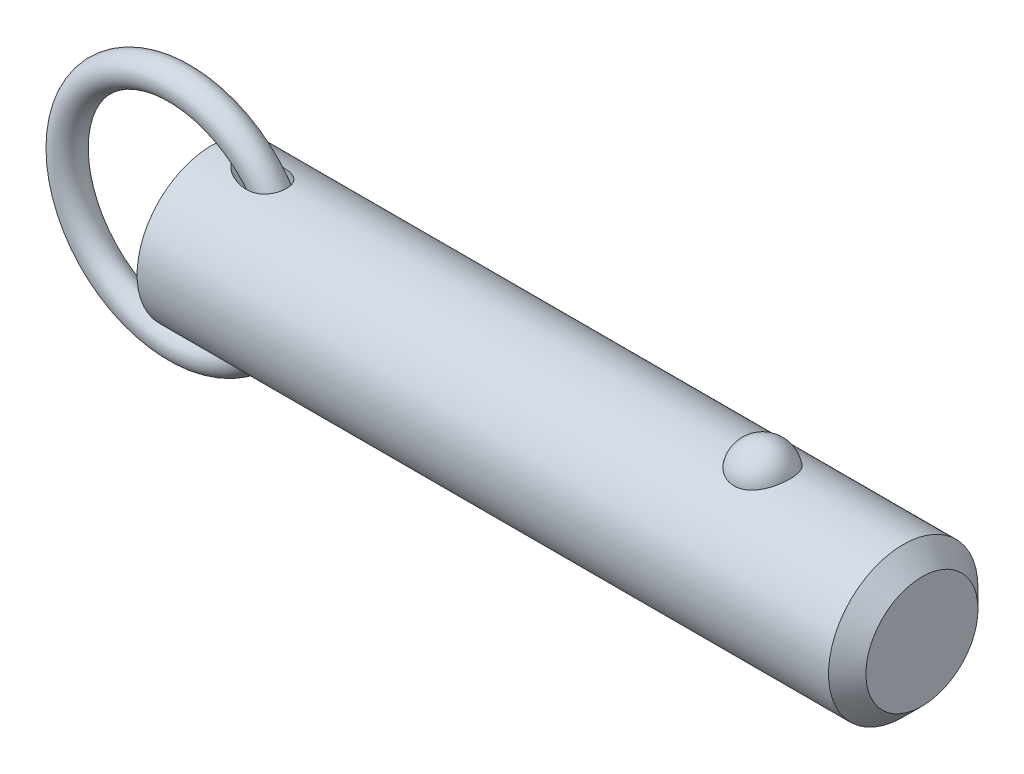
ISO-10303-21;
HEADER;
FILE_DESCRIPTION(('STEP AP214'),'2;1');
FILE_NAME('part.step','',(''),(''),'','','');
FILE_SCHEMA(('AUTOMOTIVE_DESIGN { 1 0 10303 214 1 1 1 1 }'));
ENDSEC;
DATA;
#1=APPLICATION_CONTEXT('core data for automotive mechanical design processes');
#2=APPLICATION_PROTOCOL_DEFINITION('international standard','automotive_design',2000,#1);
#3=PRODUCT_CONTEXT('',#1,'mechanical');
#4=PRODUCT('Part','Part','',(#3));
#5=PRODUCT_RELATED_PRODUCT_CATEGORY('part','',(#4));
#6=PRODUCT_DEFINITION_FORMATION('','',#4);
#7=PRODUCT_DEFINITION_CONTEXT('part definition',#1,'design');
#8=PRODUCT_DEFINITION('design','',#6,#7);
#9=PRODUCT_DEFINITION_SHAPE('','',#8);
#10=(LENGTH_UNIT() NAMED_UNIT(*) SI_UNIT(.MILLI.,.METRE.));
#11=(NAMED_UNIT(*) PLANE_ANGLE_UNIT() SI_UNIT($,.RADIAN.));
#12=(NAMED_UNIT(*) SI_UNIT($,.STERADIAN.) SOLID_ANGLE_UNIT());
#13=UNCERTAINTY_MEASURE_WITH_UNIT(LENGTH_MEASURE(1.E-05),#10,'distance_accuracy_value','');
#14=(GEOMETRIC_REPRESENTATION_CONTEXT(3) GLOBAL_UNCERTAINTY_ASSIGNED_CONTEXT((#13)) GLOBAL_UNIT_ASSIGNED_CONTEXT((#10,
#11,#12)) REPRESENTATION_CONTEXT('',''));
#15=CARTESIAN_POINT('',(0.,0.,0.));
#16=DIRECTION('',(0.,0.,1.));
#17=DIRECTION('',(1.,0.,0.));
#18=AXIS2_PLACEMENT_3D('',#15,#16,#17);
#19=CARTESIAN_POINT('',(-5.53898640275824,0.,0.));
#20=DIRECTION('',(0.,0.,1.));
#21=DIRECTION('',(1.,0.,0.));
#22=AXIS2_PLACEMENT_3D('',#19,#20,#21);
#23=TOROIDAL_SURFACE('',#22,19.05,2.54);
#24=CARTESIAN_POINT('',(16.0510135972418,0.,0.));
#25=VERTEX_POINT('',#24);
#26=VERTEX_LOOP('',#25);
#27=FACE_BOUND('',#26,.T.);
#28=ADVANCED_FACE('P0_F12',(#27),#23,.T.);
#29=CLOSED_SHELL('',(#28));
#30=MANIFOLD_SOLID_BREP('P0_B1',#29);
#31=CARTESIAN_POINT('',(0.,0.,0.));
#32=DIRECTION('',(1.,0.,0.));
#33=DIRECTION('',(0.,0.,-1.));
#34=AXIS2_PLACEMENT_3D('',#31,#32,#33);
#35=CYLINDRICAL_SURFACE('',#34,12.7);
#36=CARTESIAN_POINT('',(117.475,0.,0.));
#37=DIRECTION('',(1.,0.,0.));
#38=DIRECTION('',(0.,0.,-1.));
#39=AXIS2_PLACEMENT_3D('',#36,#37,#38);
#40=CIRCLE('',#39,12.7);
#41=CARTESIAN_POINT('',(117.475,0.,-12.7));
#42=VERTEX_POINT('',#41);
#43=EDGE_CURVE('P1_E89',#42,#42,#40,.T.);
#44=ORIENTED_EDGE('',*,*,#43,.F.);
#45=EDGE_LOOP('',(#44));
#46=FACE_BOUND('',#45,.T.);
#47=CARTESIAN_POINT('',(0.,0.,0.));
#48=DIRECTION('',(1.,0.,0.));
#49=DIRECTION('',(0.,0.,-1.));
#50=AXIS2_PLACEMENT_3D('',#47,#48,#49);
#51=CIRCLE('',#50,12.7);
#52=CARTESIAN_POINT('',(0.,0.,-12.7));
#53=VERTEX_POINT('',#52);
#54=EDGE_CURVE('P1_E52',#53,#53,#51,.T.);
#55=ORIENTED_EDGE('',*,*,#54,.T.);
#56=EDGE_LOOP('',(#55));
#57=FACE_BOUND('',#56,.T.);
#58=CARTESIAN_POINT('',(93.5600429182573,11.7500437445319,4.81938502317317));
#59=CARTESIAN_POINT('',(93.4350881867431,11.7500430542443,4.8193857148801));
#60=CARTESIAN_POINT('',(93.3101442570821,11.7520975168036,4.81438658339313));
#61=CARTESIAN_POINT('',(93.0611425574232,11.760253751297,4.79442904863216));
#62=CARTESIAN_POINT('',(92.9370850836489,11.7663568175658,4.77946746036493));
#63=CARTESIAN_POINT('',(92.6909016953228,11.7824262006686,4.73971414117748));
#64=CARTESIAN_POINT('',(92.5687744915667,11.7923898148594,4.71492928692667));
#65=CARTESIAN_POINT('',(92.3271874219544,11.8158938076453,4.65571340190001));
#66=CARTESIAN_POINT('',(92.2077285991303,11.8294355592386,4.62127866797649));
#67=CARTESIAN_POINT('',(91.9725578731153,11.8596812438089,4.54309502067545));
#68=CARTESIAN_POINT('',(91.8568393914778,11.8763792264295,4.49936361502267));
#69=CARTESIAN_POINT('',(91.6296530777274,11.9124878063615,4.40287235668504));
#70=CARTESIAN_POINT('',(91.5181868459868,11.9318994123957,4.35010914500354));
#71=CARTESIAN_POINT('',(91.1912782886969,11.9934256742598,4.1788131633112));
#72=CARTESIAN_POINT('',(90.9831270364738,12.038858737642,4.04720756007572));
#73=CARTESIAN_POINT('',(90.5858509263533,12.1352173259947,3.74856446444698));
#74=CARTESIAN_POINT('',(90.3974438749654,12.1862630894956,3.58061821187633));
#75=CARTESIAN_POINT('',(90.0505213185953,12.2875163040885,3.21600758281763));
#76=CARTESIAN_POINT('',(89.8920113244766,12.3377235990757,3.01933792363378));
#77=CARTESIAN_POINT('',(89.6016887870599,12.4344923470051,2.59291655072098));
#78=CARTESIAN_POINT('',(89.4713762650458,12.4807925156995,2.36208286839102));
#79=CARTESIAN_POINT('',(89.2494079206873,12.5623454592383,1.88070399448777));
#80=CARTESIAN_POINT('',(89.1577554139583,12.5975972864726,1.63015711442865));
#81=CARTESIAN_POINT('',(89.0140466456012,12.6538414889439,1.11298869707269));
#82=CARTESIAN_POINT('',(88.9624990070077,12.6746503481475,0.846205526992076));
#83=CARTESIAN_POINT('',(88.9019771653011,12.699153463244,0.307085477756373));
#84=CARTESIAN_POINT('',(88.8930018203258,12.7028481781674,0.0347487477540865));
#85=CARTESIAN_POINT('',(88.9177310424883,12.6927785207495,-0.506073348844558));
#86=CARTESIAN_POINT('',(88.9511899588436,12.6791146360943,-0.774571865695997));
#87=CARTESIAN_POINT('',(89.059687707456,12.635882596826,-1.30170246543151));
#88=CARTESIAN_POINT('',(89.1347272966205,12.606314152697,-1.5603343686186));
#89=CARTESIAN_POINT('',(89.3250000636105,12.5342328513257,-2.06083899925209));
#90=CARTESIAN_POINT('',(89.4402872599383,12.4917026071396,-2.30268867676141));
#91=CARTESIAN_POINT('',(89.7087044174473,12.3981123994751,-2.76259600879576));
#92=CARTESIAN_POINT('',(89.8618374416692,12.3470517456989,-2.98065173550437));
#93=CARTESIAN_POINT('',(90.2035077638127,12.2416045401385,-3.38786328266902));
#94=CARTESIAN_POINT('',(90.3922017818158,12.1872040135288,-3.57688418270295));
#95=CARTESIAN_POINT('',(90.8002392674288,12.0814086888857,-3.91941073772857));
#96=CARTESIAN_POINT('',(91.0195800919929,12.0300136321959,-4.07291945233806));
#97=CARTESIAN_POINT('',(91.4783753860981,11.9373542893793,-4.33691289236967));
#98=CARTESIAN_POINT('',(91.717304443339,11.8958982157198,-4.44824125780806));
#99=CARTESIAN_POINT('',(92.2124376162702,11.8268116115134,-4.62881985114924));
#100=CARTESIAN_POINT('',(92.4686351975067,11.7991758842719,-4.69808589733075));
#101=CARTESIAN_POINT('',(92.9771640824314,11.7622209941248,-4.78983181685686));
#102=CARTESIAN_POINT('',(93.2290414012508,11.7520502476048,-4.81449025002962));
#103=CARTESIAN_POINT('',(93.7335734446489,11.7485796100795,-4.82295735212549));
#104=CARTESIAN_POINT('',(93.9862280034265,11.7552763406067,-4.80677420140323));
#105=CARTESIAN_POINT('',(94.476834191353,11.7842584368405,-4.735254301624));
#106=CARTESIAN_POINT('',(94.7149984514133,11.8060486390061,-4.68116061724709));
#107=CARTESIAN_POINT('',(95.1784894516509,11.8622750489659,-4.53678133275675));
#108=CARTESIAN_POINT('',(95.4038151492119,11.8967122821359,-4.44649279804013));
#109=CARTESIAN_POINT('',(95.8408018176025,11.9754603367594,-4.22987613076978));
#110=CARTESIAN_POINT('',(96.0520579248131,12.0199699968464,-4.10280539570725));
#111=CARTESIAN_POINT('',(96.4506012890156,12.1138028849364,-3.81685409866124));
#112=CARTESIAN_POINT('',(96.6378830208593,12.163127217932,-3.65796622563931));
#113=CARTESIAN_POINT('',(96.9933509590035,12.2642343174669,-3.30364864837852));
#114=CARTESIAN_POINT('',(97.1601119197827,12.3160165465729,-3.10678783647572));
#115=CARTESIAN_POINT('',(97.4595799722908,12.4142566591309,-2.6874840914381));
#116=CARTESIAN_POINT('',(97.5922809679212,12.4607135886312,-2.46503658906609));
#117=CARTESIAN_POINT('',(97.8246912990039,12.5450236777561,-1.99289519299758));
#118=CARTESIAN_POINT('',(97.923215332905,12.5825557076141,-1.74255918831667));
#119=CARTESIAN_POINT('',(98.0792277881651,12.6431720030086,-1.2277373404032));
#120=CARTESIAN_POINT('',(98.1367157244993,12.6662560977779,-0.963251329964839));
#121=CARTESIAN_POINT('',(98.2095441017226,12.6956486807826,-0.427355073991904));
#122=CARTESIAN_POINT('',(98.2248378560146,12.7019385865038,-0.155937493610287));
#123=CARTESIAN_POINT('',(98.2127794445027,12.6970201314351,0.385928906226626));
#124=CARTESIAN_POINT('',(98.1854280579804,12.6858120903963,0.656377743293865));
#125=CARTESIAN_POINT('',(98.1130609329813,12.6568455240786,1.05454017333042));
#126=CARTESIAN_POINT('',(98.0837963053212,12.6451962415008,1.185778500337));
#127=CARTESIAN_POINT('',(98.0150228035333,12.6181819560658,1.4451380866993));
#128=CARTESIAN_POINT('',(97.9755176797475,12.6028183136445,1.57326046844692));
#129=CARTESIAN_POINT('',(97.8864397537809,12.5687547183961,1.82554978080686));
#130=CARTESIAN_POINT('',(97.8368627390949,12.5500533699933,1.9497150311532));
#131=CARTESIAN_POINT('',(97.7279211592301,12.5098093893,2.19314370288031));
#132=CARTESIAN_POINT('',(97.6685601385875,12.4882677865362,2.31240887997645));
#133=CARTESIAN_POINT('',(97.5399712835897,12.4427679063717,2.54593031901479));
#134=CARTESIAN_POINT('',(97.4706888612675,12.4187964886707,2.66015396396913));
#135=CARTESIAN_POINT('',(97.322903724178,12.3691892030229,2.88202659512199));
#136=CARTESIAN_POINT('',(97.2444044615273,12.3435539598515,2.98967802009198));
#137=CARTESIAN_POINT('',(97.0785502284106,12.2912955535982,3.19774385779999));
#138=CARTESIAN_POINT('',(96.9911918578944,12.2646720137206,3.29815546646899));
#139=CARTESIAN_POINT('',(96.8081617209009,12.2111945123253,3.49095035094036));
#140=CARTESIAN_POINT('',(96.7124932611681,12.1843406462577,3.58333679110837));
#141=CARTESIAN_POINT('',(96.5136272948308,12.1312249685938,3.75922876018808));
#142=CARTESIAN_POINT('',(96.4104503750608,12.104961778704,3.84275713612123));
#143=CARTESIAN_POINT('',(96.1970133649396,12.0537284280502,4.00056406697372));
#144=CARTESIAN_POINT('',(96.0867562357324,12.028757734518,4.07484645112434));
#145=CARTESIAN_POINT('',(95.8597550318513,11.9808306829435,4.21367959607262));
#146=CARTESIAN_POINT('',(95.7430068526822,11.9578756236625,4.27822410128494));
#147=CARTESIAN_POINT('',(95.5039425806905,11.9147184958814,4.39698483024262));
#148=CARTESIAN_POINT('',(95.3816287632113,11.894515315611,4.45120522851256));
#149=CARTESIAN_POINT('',(95.122952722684,11.8561129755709,4.55255353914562));
#150=CARTESIAN_POINT('',(94.9862237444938,11.8381764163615,4.59884858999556));
#151=CARTESIAN_POINT('',(94.7086087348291,11.8069093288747,4.678538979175));
#152=CARTESIAN_POINT('',(94.5677245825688,11.7935767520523,4.71194005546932));
#153=CARTESIAN_POINT('',(94.2830944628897,11.7720277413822,4.76552188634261));
#154=CARTESIAN_POINT('',(94.1393488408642,11.7638106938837,4.78570422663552));
#155=CARTESIAN_POINT('',(93.8504114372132,11.7528195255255,4.81263433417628));
#156=CARTESIAN_POINT('',(93.7052198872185,11.7500445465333,4.81938421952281));
#157=CARTESIAN_POINT('',(93.5600429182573,11.7500437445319,4.81938502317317));
#158=B_SPLINE_CURVE_WITH_KNOTS('',3,(#58,#59,#60,#61,#62,#63,#64,#65,#66,#67,#68,#69,#70,#71,
#72,#73,#74,#75,#76,#77,#78,#79,#80,#81,#82,#83,#84,#85,#86,#87,#88,#89,#90,#91,#92,#93,#94,#95,
#96,#97,#98,#99,#100,#101,#102,#103,#104,#105,#106,#107,#108,#109,#110,#111,#112,#113,#114,#115,
#116,#117,#118,#119,#120,#121,#122,#123,#124,#125,#126,#127,#128,#129,#130,#131,#132,#133,#134,
#135,#136,#137,#138,#139,#140,#141,#142,#143,#144,#145,#146,#147,#148,#149,#150,#151,#152,#153,
#154,#155,#156,#157),.UNSPECIFIED.,.T.,.F.,(4,2,2,2,2,2,2,2,2,2,2,2,2,2,2,2,2,2,2,2,2,2,2,2,2,2,
2,2,2,2,2,2,2,2,2,2,2,2,2,2,2,2,2,2,2,2,2,2,2,4),(0.,0.374729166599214,0.749578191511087,
1.1241652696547,1.49889629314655,1.87292776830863,2.24709865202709,2.99481328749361,
3.76399449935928,4.53331735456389,5.3368391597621,6.14042986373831,6.95405296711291,
7.76765424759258,8.57656703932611,9.38549455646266,10.1955119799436,11.0055949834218,
11.8193353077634,12.6330054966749,13.4294141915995,14.2255231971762,14.9815786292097,
15.7374826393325,16.4696948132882,17.2019663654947,17.9501979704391,18.6986017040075,
19.484470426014,20.2704797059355,21.0815215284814,21.8925729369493,22.7045213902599,
23.5164550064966,23.9209608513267,24.3253187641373,24.7298461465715,25.1342272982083,
25.54092555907,25.9474719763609,26.3541750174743,26.7607169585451,27.1661834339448,
27.5714814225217,27.9770386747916,28.382431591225,28.818120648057,29.2536155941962,
29.6890582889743,30.1244323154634),.UNSPECIFIED.);
#159=CARTESIAN_POINT('',(93.5600429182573,11.7500437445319,4.81938502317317));
#160=VERTEX_POINT('',#159);
#161=EDGE_CURVE('P1_E80',#160,#160,#158,.T.);
#162=ORIENTED_EDGE('',*,*,#161,.T.);
#163=EDGE_LOOP('',(#162));
#164=FACE_BOUND('',#163,.T.);
#165=CARTESIAN_POINT('',(-5.53898640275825,0.,0.));
#166=DIRECTION('',(0.796400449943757,-0.604769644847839,0.));
#167=DIRECTION('',(0.604769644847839,0.796400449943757,0.));
#168=AXIS2_PLACEMENT_3D('',#165,#166,#167);
#169=ELLIPSE('',#168,15.9467514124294,12.7);
#170=CARTESIAN_POINT('',(4.09482149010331,12.6864319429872,0.586893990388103));
#171=VERTEX_POINT('',#170);
#172=CARTESIAN_POINT('',(4.09482149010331,12.6864319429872,-0.586893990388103));
#173=VERTEX_POINT('',#172);
#174=EDGE_CURVE('P1_E47',#171,#173,#169,.F.);
#175=ORIENTED_EDGE('',*,*,#174,.T.);
#176=CARTESIAN_POINT('',(4.06153170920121,12.6905758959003,-0.48916605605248));
#177=CARTESIAN_POINT('',(4.08111374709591,12.6881366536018,-0.552489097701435));
#178=CARTESIAN_POINT('',(4.10417851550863,12.6852663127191,-0.614604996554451));
#179=CARTESIAN_POINT('',(4.15628434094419,12.6787965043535,-0.736067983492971));
#180=CARTESIAN_POINT('',(4.18531032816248,12.6751988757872,-0.795421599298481));
#181=CARTESIAN_POINT('',(4.27911159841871,12.6636052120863,-0.967590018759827));
#182=CARTESIAN_POINT('',(4.35123408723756,12.654730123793,-1.07635920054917));
#183=CARTESIAN_POINT('',(4.49106800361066,12.6376715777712,-1.25922957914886));
#184=CARTESIAN_POINT('',(4.5560106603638,12.6297947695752,-1.33556751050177));
#185=CARTESIAN_POINT('',(4.69223626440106,12.6134116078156,-1.48232741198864));
#186=CARTESIAN_POINT('',(4.7635214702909,12.6049050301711,-1.55274725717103));
#187=CARTESIAN_POINT('',(4.91163946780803,12.587417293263,-1.68868704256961));
#188=CARTESIAN_POINT('',(4.98851399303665,12.5784327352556,-1.75416062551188));
#189=CARTESIAN_POINT('',(5.14630057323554,12.560235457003,-1.88003275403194));
#190=CARTESIAN_POINT('',(5.22721398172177,12.5510226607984,-1.94042957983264));
#191=CARTESIAN_POINT('',(5.45368877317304,12.5256514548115,-2.09966332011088));
#192=CARTESIAN_POINT('',(5.60261616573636,12.5094182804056,-2.19371988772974));
#193=CARTESIAN_POINT('',(5.90795545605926,12.4774211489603,-2.36893890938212));
#194=CARTESIAN_POINT('',(6.06437232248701,12.4616575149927,-2.45009264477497));
#195=CARTESIAN_POINT('',(6.38306132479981,12.431227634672,-2.60008249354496));
#196=CARTESIAN_POINT('',(6.54533237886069,12.4165611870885,-2.66892086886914));
#197=CARTESIAN_POINT('',(6.87462618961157,12.3889351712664,-2.79435199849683));
#198=CARTESIAN_POINT('',(7.0416477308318,12.3759751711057,-2.85094785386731));
#199=CARTESIAN_POINT('',(7.38726647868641,12.3518460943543,-2.95377962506));
#200=CARTESIAN_POINT('',(7.56604577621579,12.3407843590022,-2.9994320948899));
#201=CARTESIAN_POINT('',(7.92698692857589,12.3219309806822,-3.07596683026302));
#202=CARTESIAN_POINT('',(8.10914972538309,12.314140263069,-3.1068449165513));
#203=CARTESIAN_POINT('',(8.47511457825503,12.3025918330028,-3.15226850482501));
#204=CARTESIAN_POINT('',(8.6589097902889,12.2988216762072,-3.16686440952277));
#205=CARTESIAN_POINT('',(9.02696087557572,12.2959421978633,-3.17802250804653));
#206=CARTESIAN_POINT('',(9.21121628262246,12.2968292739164,-3.17459864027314));
#207=CARTESIAN_POINT('',(9.61636263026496,12.3045198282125,-3.14471110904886));
#208=CARTESIAN_POINT('',(9.83695552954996,12.3125080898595,-3.1136323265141));
#209=CARTESIAN_POINT('',(10.1619126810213,12.3303028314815,-3.04206574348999));
#210=CARTESIAN_POINT('',(10.2692747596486,12.3372061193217,-3.01403983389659));
#211=CARTESIAN_POINT('',(10.4811758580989,12.3528538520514,-2.94925947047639));
#212=CARTESIAN_POINT('',(10.5857162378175,12.361597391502,-2.91250930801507));
#213=CARTESIAN_POINT('',(10.7921321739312,12.3808585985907,-2.82951748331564));
#214=CARTESIAN_POINT('',(10.8939665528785,12.3913944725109,-2.78317723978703));
#215=CARTESIAN_POINT('',(11.0926118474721,12.4138762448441,-2.68112002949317));
#216=CARTESIAN_POINT('',(11.1894254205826,12.4258213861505,-2.62540809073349));
#217=CARTESIAN_POINT('',(11.3768740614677,12.4507225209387,-2.50465655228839));
#218=CARTESIAN_POINT('',(11.46751150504,12.4636781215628,-2.43962056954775));
#219=CARTESIAN_POINT('',(11.6414572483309,12.4901070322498,-2.30048560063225));
#220=CARTESIAN_POINT('',(11.7247669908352,12.5035802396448,-2.2263884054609));
#221=CARTESIAN_POINT('',(11.8713131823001,12.5285000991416,-2.08117367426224));
#222=CARTESIAN_POINT('',(11.9357009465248,12.5399538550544,-2.0112159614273));
#223=CARTESIAN_POINT('',(12.0576805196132,12.5624496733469,-1.86555293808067));
#224=CARTESIAN_POINT('',(12.1152732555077,12.5734917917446,-1.7898484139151));
#225=CARTESIAN_POINT('',(12.2230738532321,12.5947858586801,-1.63327883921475));
#226=CARTESIAN_POINT('',(12.2732844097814,12.6050380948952,-1.55241568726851));
#227=CARTESIAN_POINT('',(12.3658430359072,12.6243983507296,-1.38621267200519));
#228=CARTESIAN_POINT('',(12.4081916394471,12.6335064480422,-1.30087311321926));
#229=CARTESIAN_POINT('',(12.5150098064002,12.6569076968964,-1.05702619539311));
#230=CARTESIAN_POINT('',(12.5703399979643,12.6695746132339,-0.894232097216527));
#231=CARTESIAN_POINT('',(12.6526225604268,12.6886816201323,-0.561391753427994));
#232=CARTESIAN_POINT('',(12.6795825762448,12.6951233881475,-0.391347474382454));
#233=CARTESIAN_POINT('',(12.7041016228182,12.7009766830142,-0.0537636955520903));
#234=CARTESIAN_POINT('',(12.7024538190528,12.7005778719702,0.113714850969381));
#235=CARTESIAN_POINT('',(12.6717240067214,12.6932548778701,0.445979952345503));
#236=CARTESIAN_POINT('',(12.6426435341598,12.6863310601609,0.610766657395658));
#237=CARTESIAN_POINT('',(12.5579769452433,12.6667465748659,0.93242957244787));
#238=CARTESIAN_POINT('',(12.5024793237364,12.6541050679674,1.08933027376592));
#239=CARTESIAN_POINT('',(12.3665691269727,12.6244558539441,1.39146752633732));
#240=CARTESIAN_POINT('',(12.2861577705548,12.6074483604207,1.53670464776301));
#241=CARTESIAN_POINT('',(12.1018203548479,12.5706804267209,1.81319588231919));
#242=CARTESIAN_POINT('',(11.9976588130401,12.5508932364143,1.94428915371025));
#243=CARTESIAN_POINT('',(11.7695265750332,12.5107540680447,2.18776051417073));
#244=CARTESIAN_POINT('',(11.6455540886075,12.4904020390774,2.30013691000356));
#245=CARTESIAN_POINT('',(11.3759347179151,12.4502278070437,2.50870972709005));
#246=CARTESIAN_POINT('',(11.2295880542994,12.4304654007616,2.60400962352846));
#247=CARTESIAN_POINT('',(10.9239803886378,12.3941696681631,2.7716292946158));
#248=CARTESIAN_POINT('',(10.7647152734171,12.3776373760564,2.84394171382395));
#249=CARTESIAN_POINT('',(10.4192039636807,12.3473062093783,2.9730352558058));
#250=CARTESIAN_POINT('',(10.231933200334,12.3340204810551,3.02717164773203));
#251=CARTESIAN_POINT('',(9.85152982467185,12.3134301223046,3.10986173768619));
#252=CARTESIAN_POINT('',(9.65839336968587,12.3061295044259,3.13839827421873));
#253=CARTESIAN_POINT('',(9.31022514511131,12.2982822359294,3.16897517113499));
#254=CARTESIAN_POINT('',(9.15555718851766,12.2966525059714,3.1752689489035));
#255=CARTESIAN_POINT('',(8.84618945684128,12.2967963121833,3.17471335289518));
#256=CARTESIAN_POINT('',(8.69148970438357,12.2985715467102,3.16785742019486));
#257=CARTESIAN_POINT('',(8.38280471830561,12.3051648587,3.14214692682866));
#258=CARTESIAN_POINT('',(8.22882218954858,12.3099904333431,3.12326280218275));
#259=CARTESIAN_POINT('',(7.92276070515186,12.3222644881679,3.07448013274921));
#260=CARTESIAN_POINT('',(7.77068148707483,12.3297126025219,3.04458312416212));
#261=CARTESIAN_POINT('',(7.46452663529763,12.3470493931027,2.97350781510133));
#262=CARTESIAN_POINT('',(7.31052714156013,12.3570043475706,2.93201910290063));
#263=CARTESIAN_POINT('',(7.00579083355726,12.3787609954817,2.83876185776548));
#264=CARTESIAN_POINT('',(6.85505451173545,12.3905629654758,2.78699178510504));
#265=CARTESIAN_POINT('',(6.55781208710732,12.415528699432,2.6735774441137));
#266=CARTESIAN_POINT('',(6.41129783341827,12.4286895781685,2.61195394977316));
#267=CARTESIAN_POINT('',(6.12302950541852,12.4559398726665,2.47874512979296));
#268=CARTESIAN_POINT('',(5.981273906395,12.4700289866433,2.40716303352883));
#269=CARTESIAN_POINT('',(5.6707312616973,12.5020754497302,2.2355042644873));
#270=CARTESIAN_POINT('',(5.50343839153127,12.5201625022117,2.13268685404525));
#271=CARTESIAN_POINT('',(5.26147616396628,12.5471537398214,1.96522579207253));
#272=CARTESIAN_POINT('',(5.18224299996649,12.5561365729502,1.90713440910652));
#273=CARTESIAN_POINT('',(5.02746475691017,12.573912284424,1.78618989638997));
#274=CARTESIAN_POINT('',(4.9519191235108,12.5827051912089,1.72333748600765));
#275=CARTESIAN_POINT('',(4.81787163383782,12.598469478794,1.60360864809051));
#276=CARTESIAN_POINT('',(4.75865966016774,12.6054958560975,1.54753994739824));
#277=CARTESIAN_POINT('',(4.64406285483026,12.6191906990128,1.43158546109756));
#278=CARTESIAN_POINT('',(4.58867926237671,12.6258590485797,1.37169845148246));
#279=CARTESIAN_POINT('',(4.43014912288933,12.6450546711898,1.18656670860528));
#280=CARTESIAN_POINT('',(4.3337272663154,12.6568788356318,1.05507993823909));
#281=CARTESIAN_POINT('',(4.21252055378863,12.6718304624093,0.848052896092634));
#282=CARTESIAN_POINT('',(4.17660155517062,12.6762773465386,0.779100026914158));
#283=CARTESIAN_POINT('',(4.11264979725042,12.6842122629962,0.637080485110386));
#284=CARTESIAN_POINT('',(4.08466792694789,12.6876941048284,0.563990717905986));
#285=CARTESIAN_POINT('',(4.06153170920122,12.6905758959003,0.489166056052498));
#286=B_SPLINE_CURVE_WITH_KNOTS('',3,(#176,#177,#178,#179,#180,#181,#182,#183,#184,#185,#186,
#187,#188,#189,#190,#191,#192,#193,#194,#195,#196,#197,#198,#199,#200,#201,#202,#203,#204,#205,
#206,#207,#208,#209,#210,#211,#212,#213,#214,#215,#216,#217,#218,#219,#220,#221,#222,#223,#224,
#225,#226,#227,#228,#229,#230,#231,#232,#233,#234,#235,#236,#237,#238,#239,#240,#241,#242,#243,
#244,#245,#246,#247,#248,#249,#250,#251,#252,#253,#254,#255,#256,#257,#258,#259,#260,#261,#262,
#263,#264,#265,#266,#267,#268,#269,#270,#271,#272,#273,#274,#275,#276,#277,#278,#279,#280,#281,
#282,#283,#284,#285),.UNSPECIFIED.,.F.,.F.,(4,2,2,2,2,2,2,2,2,2,2,2,2,2,2,2,2,2,2,2,2,2,2,2,2,2,
2,2,2,2,2,2,2,2,2,2,2,2,2,2,2,2,2,2,2,2,2,2,2,2,2,2,2,2,4),(0.,0.198708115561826,
0.39691995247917,0.787580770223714,1.08882492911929,1.39017679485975,1.69407136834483,
1.99806847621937,2.52793143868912,3.05815092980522,3.58827293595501,4.11826050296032,
4.67218806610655,5.22627222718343,5.77863637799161,6.3305733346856,6.99657211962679,
7.32977411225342,7.66281254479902,7.99946156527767,8.33593054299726,8.67226935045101,
9.00854178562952,9.29544181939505,9.58230266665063,9.86905853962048,10.1557949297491,
10.6702338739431,11.1845341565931,11.6845985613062,12.1846349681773,12.6830079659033,
13.1813565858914,13.68487951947,14.1884479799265,14.713533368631,15.2387866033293,
15.8228373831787,16.407279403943,16.8710810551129,17.3351141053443,17.8002921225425,
18.2654052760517,18.7444169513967,19.2235004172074,19.7015868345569,20.1795185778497,
20.7699825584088,21.0658110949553,21.3615950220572,21.606957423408,21.8523988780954,
22.3397467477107,22.5729183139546,22.8075527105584),.UNSPECIFIED.);
#287=EDGE_CURVE('P1_E51',#173,#171,#286,.T.);
#288=ORIENTED_EDGE('',*,*,#287,.T.);
#289=EDGE_LOOP('',(#175,#288));
#290=FACE_BOUND('',#289,.T.);
#291=CARTESIAN_POINT('',(-5.53898640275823,0.,0.));
#292=DIRECTION('',(-0.796400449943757,-0.604769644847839,0.));
#293=DIRECTION('',(0.604769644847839,-0.796400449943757,0.));
#294=AXIS2_PLACEMENT_3D('',#291,#292,#293);
#295=ELLIPSE('',#294,15.9467514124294,12.7);
#296=CARTESIAN_POINT('',(4.09482149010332,-12.6864319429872,0.586893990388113));
#297=VERTEX_POINT('',#296);
#298=CARTESIAN_POINT('',(4.09482149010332,-12.6864319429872,-0.586893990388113));
#299=VERTEX_POINT('',#298);
#300=EDGE_CURVE('P1_E28',#297,#299,#295,.F.);
#301=ORIENTED_EDGE('',*,*,#300,.F.);
#302=CARTESIAN_POINT('',(4.06153170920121,-12.6905758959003,0.489166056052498));
#303=CARTESIAN_POINT('',(4.08111374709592,-12.6881366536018,0.552489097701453));
#304=CARTESIAN_POINT('',(4.10417851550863,-12.6852663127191,0.614604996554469));
#305=CARTESIAN_POINT('',(4.1562843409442,-12.6787965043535,0.736067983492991));
#306=CARTESIAN_POINT('',(4.18531032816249,-12.6751988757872,0.795421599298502));
#307=CARTESIAN_POINT('',(4.27911159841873,-12.6636052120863,0.96759001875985));
#308=CARTESIAN_POINT('',(4.35123408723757,-12.654730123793,1.07635920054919));
#309=CARTESIAN_POINT('',(4.49106800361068,-12.6376715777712,1.25922957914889));
#310=CARTESIAN_POINT('',(4.55601066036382,-12.6297947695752,1.3355675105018));
#311=CARTESIAN_POINT('',(4.69223626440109,-12.6134116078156,1.48232741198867));
#312=CARTESIAN_POINT('',(4.76352147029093,-12.6049050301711,1.55274725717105));
#313=CARTESIAN_POINT('',(4.91163946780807,-12.587417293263,1.68868704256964));
#314=CARTESIAN_POINT('',(4.98851399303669,-12.5784327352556,1.7541606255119));
#315=CARTESIAN_POINT('',(5.14630057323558,-12.560235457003,1.88003275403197));
#316=CARTESIAN_POINT('',(5.22721398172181,-12.5510226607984,1.94042957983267));
#317=CARTESIAN_POINT('',(5.45368877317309,-12.5256514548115,2.09966332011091));
#318=CARTESIAN_POINT('',(5.60261616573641,-12.5094182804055,2.19371988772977));
#319=CARTESIAN_POINT('',(5.90795545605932,-12.4774211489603,2.36893890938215));
#320=CARTESIAN_POINT('',(6.06437232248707,-12.4616575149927,2.450092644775));
#321=CARTESIAN_POINT('',(6.38306132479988,-12.431227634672,2.60008249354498));
#322=CARTESIAN_POINT('',(6.54533237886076,-12.4165611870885,2.66892086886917));
#323=CARTESIAN_POINT('',(6.87462618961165,-12.3889351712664,2.79435199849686));
#324=CARTESIAN_POINT('',(7.04164773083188,-12.3759751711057,2.85094785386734));
#325=CARTESIAN_POINT('',(7.38726647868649,-12.3518460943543,2.95377962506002));
#326=CARTESIAN_POINT('',(7.56604577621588,-12.3407843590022,2.99943209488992));
#327=CARTESIAN_POINT('',(7.92698692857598,-12.3219309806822,3.07596683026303));
#328=CARTESIAN_POINT('',(8.10914972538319,-12.314140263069,3.10684491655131));
#329=CARTESIAN_POINT('',(8.47511457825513,-12.3025918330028,3.15226850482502));
#330=CARTESIAN_POINT('',(8.658909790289,-12.2988216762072,3.16686440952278));
#331=CARTESIAN_POINT('',(9.02696087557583,-12.2959421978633,3.17802250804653));
#332=CARTESIAN_POINT('',(9.21121628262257,-12.2968292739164,3.17459864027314));
#333=CARTESIAN_POINT('',(9.61636263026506,-12.3045198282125,3.14471110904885));
#334=CARTESIAN_POINT('',(9.83695552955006,-12.3125080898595,3.11363232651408));
#335=CARTESIAN_POINT('',(10.1619126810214,-12.3303028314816,3.04206574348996));
#336=CARTESIAN_POINT('',(10.2692747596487,-12.3372061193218,3.01403983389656));
#337=CARTESIAN_POINT('',(10.481175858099,-12.3528538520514,2.94925947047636));
#338=CARTESIAN_POINT('',(10.5857162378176,-12.361597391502,2.91250930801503));
#339=CARTESIAN_POINT('',(10.7921321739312,-12.3808585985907,2.8295174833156));
#340=CARTESIAN_POINT('',(10.8939665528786,-12.3913944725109,2.78317723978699));
#341=CARTESIAN_POINT('',(11.0926118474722,-12.4138762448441,2.68112002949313));
#342=CARTESIAN_POINT('',(11.1894254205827,-12.4258213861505,2.62540809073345));
#343=CARTESIAN_POINT('',(11.3768740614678,-12.4507225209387,2.50465655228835));
#344=CARTESIAN_POINT('',(11.4675115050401,-12.4636781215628,2.4396205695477));
#345=CARTESIAN_POINT('',(11.641457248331,-12.4901070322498,2.3004856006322));
#346=CARTESIAN_POINT('',(11.7247669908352,-12.5035802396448,2.22638840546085));
#347=CARTESIAN_POINT('',(11.8713131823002,-12.5285000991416,2.08117367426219));
#348=CARTESIAN_POINT('',(11.9357009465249,-12.5399538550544,2.01121596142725));
#349=CARTESIAN_POINT('',(12.0576805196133,-12.5624496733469,1.86555293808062));
#350=CARTESIAN_POINT('',(12.1152732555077,-12.5734917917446,1.78984841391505));
#351=CARTESIAN_POINT('',(12.2230738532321,-12.5947858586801,1.6332788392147));
#352=CARTESIAN_POINT('',(12.2732844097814,-12.6050380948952,1.55241568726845));
#353=CARTESIAN_POINT('',(12.3658430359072,-12.6243983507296,1.38621267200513));
#354=CARTESIAN_POINT('',(12.4081916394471,-12.6335064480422,1.30087311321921));
#355=CARTESIAN_POINT('',(12.5150098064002,-12.6569076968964,1.05702619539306));
#356=CARTESIAN_POINT('',(12.5703399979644,-12.6695746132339,0.894232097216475));
#357=CARTESIAN_POINT('',(12.6526225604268,-12.6886816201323,0.561391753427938));
#358=CARTESIAN_POINT('',(12.6795825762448,-12.6951233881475,0.391347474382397));
#359=CARTESIAN_POINT('',(12.7041016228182,-12.7009766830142,0.0537636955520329));
#360=CARTESIAN_POINT('',(12.7024538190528,-12.7005778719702,-0.113714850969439));
#361=CARTESIAN_POINT('',(12.6717240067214,-12.6932548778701,-0.445979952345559));
#362=CARTESIAN_POINT('',(12.6426435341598,-12.6863310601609,-0.610766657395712));
#363=CARTESIAN_POINT('',(12.5579769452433,-12.6667465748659,-0.93242957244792));
#364=CARTESIAN_POINT('',(12.5024793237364,-12.6541050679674,-1.08933027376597));
#365=CARTESIAN_POINT('',(12.3665691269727,-12.6244558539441,-1.39146752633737));
#366=CARTESIAN_POINT('',(12.2861577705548,-12.6074483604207,-1.53670464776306));
#367=CARTESIAN_POINT('',(12.1018203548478,-12.5706804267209,-1.81319588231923));
#368=CARTESIAN_POINT('',(11.99765881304,-12.5508932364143,-1.94428915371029));
#369=CARTESIAN_POINT('',(11.7695265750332,-12.5107540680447,-2.18776051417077));
#370=CARTESIAN_POINT('',(11.6455540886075,-12.4904020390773,-2.3001369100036));
#371=CARTESIAN_POINT('',(11.375934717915,-12.4502278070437,-2.50870972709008));
#372=CARTESIAN_POINT('',(11.2295880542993,-12.4304654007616,-2.60400962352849));
#373=CARTESIAN_POINT('',(10.9239803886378,-12.3941696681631,-2.77162929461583));
#374=CARTESIAN_POINT('',(10.764715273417,-12.3776373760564,-2.84394171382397));
#375=CARTESIAN_POINT('',(10.4192039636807,-12.3473062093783,-2.97303525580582));
#376=CARTESIAN_POINT('',(10.2319332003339,-12.3340204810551,-3.02717164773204));
#377=CARTESIAN_POINT('',(9.85152982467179,-12.3134301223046,-3.1098617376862));
#378=CARTESIAN_POINT('',(9.65839336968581,-12.3061295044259,-3.13839827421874));
#379=CARTESIAN_POINT('',(9.31022514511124,-12.2982822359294,-3.168975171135));
#380=CARTESIAN_POINT('',(9.15555718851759,-12.2966525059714,-3.1752689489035));
#381=CARTESIAN_POINT('',(8.8461894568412,-12.2967963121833,-3.17471335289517));
#382=CARTESIAN_POINT('',(8.69148970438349,-12.2985715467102,-3.16785742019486));
#383=CARTESIAN_POINT('',(8.38280471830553,-12.3051648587,-3.14214692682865));
#384=CARTESIAN_POINT('',(8.2288221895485,-12.3099904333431,-3.12326280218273));
#385=CARTESIAN_POINT('',(7.92276070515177,-12.3222644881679,-3.07448013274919));
#386=CARTESIAN_POINT('',(7.77068148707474,-12.329712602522,-3.0445831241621));
#387=CARTESIAN_POINT('',(7.46452663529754,-12.3470493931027,-2.9735078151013));
#388=CARTESIAN_POINT('',(7.31052714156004,-12.3570043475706,-2.9320191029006));
#389=CARTESIAN_POINT('',(7.00579083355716,-12.3787609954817,-2.83876185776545));
#390=CARTESIAN_POINT('',(6.85505451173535,-12.3905629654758,-2.78699178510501));
#391=CARTESIAN_POINT('',(6.55781208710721,-12.415528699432,-2.67357744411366));
#392=CARTESIAN_POINT('',(6.41129783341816,-12.4286895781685,-2.61195394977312));
#393=CARTESIAN_POINT('',(6.12302950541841,-12.4559398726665,-2.47874512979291));
#394=CARTESIAN_POINT('',(5.98127390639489,-12.4700289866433,-2.40716303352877));
#395=CARTESIAN_POINT('',(5.67073126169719,-12.5020754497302,-2.23550426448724));
#396=CARTESIAN_POINT('',(5.50343839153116,-12.5201625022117,-2.13268685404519));
#397=CARTESIAN_POINT('',(5.26147616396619,-12.5471537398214,-1.96522579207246));
#398=CARTESIAN_POINT('',(5.1822429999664,-12.5561365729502,-1.90713440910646));
#399=CARTESIAN_POINT('',(5.02746475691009,-12.573912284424,-1.7861898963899));
#400=CARTESIAN_POINT('',(4.95191912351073,-12.5827051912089,-1.72333748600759));
#401=CARTESIAN_POINT('',(4.81787163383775,-12.598469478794,-1.60360864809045));
#402=CARTESIAN_POINT('',(4.75865966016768,-12.6054958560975,-1.54753994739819));
#403=CARTESIAN_POINT('',(4.6440628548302,-12.6191906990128,-1.4315854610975));
#404=CARTESIAN_POINT('',(4.58867926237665,-12.6258590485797,-1.3716984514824));
#405=CARTESIAN_POINT('',(4.43014912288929,-12.6450546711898,-1.18656670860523));
#406=CARTESIAN_POINT('',(4.33372726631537,-12.6568788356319,-1.05507993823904));
#407=CARTESIAN_POINT('',(4.2125205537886,-12.6718304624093,-0.848052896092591));
#408=CARTESIAN_POINT('',(4.17660155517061,-12.6762773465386,-0.779100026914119));
#409=CARTESIAN_POINT('',(4.11264979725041,-12.6842122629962,-0.637080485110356));
#410=CARTESIAN_POINT('',(4.08466792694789,-12.6876941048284,-0.563990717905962));
#411=CARTESIAN_POINT('',(4.06153170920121,-12.6905758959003,-0.489166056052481));
#412=B_SPLINE_CURVE_WITH_KNOTS('',3,(#302,#303,#304,#305,#306,#307,#308,#309,#310,#311,#312,
#313,#314,#315,#316,#317,#318,#319,#320,#321,#322,#323,#324,#325,#326,#327,#328,#329,#330,#331,
#332,#333,#334,#335,#336,#337,#338,#339,#340,#341,#342,#343,#344,#345,#346,#347,#348,#349,#350,
#351,#352,#353,#354,#355,#356,#357,#358,#359,#360,#361,#362,#363,#364,#365,#366,#367,#368,#369,
#370,#371,#372,#373,#374,#375,#376,#377,#378,#379,#380,#381,#382,#383,#384,#385,#386,#387,#388,
#389,#390,#391,#392,#393,#394,#395,#396,#397,#398,#399,#400,#401,#402,#403,#404,#405,#406,#407,
#408,#409,#410,#411),.UNSPECIFIED.,.F.,.F.,(4,2,2,2,2,2,2,2,2,2,2,2,2,2,2,2,2,2,2,2,2,2,2,2,2,2,
2,2,2,2,2,2,2,2,2,2,2,2,2,2,2,2,2,2,2,2,2,2,2,2,2,2,2,2,4),(0.,0.198708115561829,
0.396919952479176,0.787580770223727,1.08882492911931,1.39017679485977,1.69407136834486,
1.9980684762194,2.52793143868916,3.05815092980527,3.58827293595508,4.11826050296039,
4.67218806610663,5.22627222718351,5.77863637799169,6.3305733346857,6.99657211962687,
7.3297741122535,7.6628125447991,7.99946156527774,8.33593054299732,8.67226935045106,
9.00854178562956,9.29544181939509,9.58230266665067,9.86905853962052,10.1557949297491,
10.6702338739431,11.1845341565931,11.6845985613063,12.1846349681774,12.6830079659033,
13.1813565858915,13.68487951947,14.1884479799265,14.7135333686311,15.2387866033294,
15.8228373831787,16.4072794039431,16.871081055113,17.3351141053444,17.8002921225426,
18.2654052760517,18.7444169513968,19.2235004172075,19.701586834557,20.1795185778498,
20.7699825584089,21.0658110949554,21.3615950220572,21.6069574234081,21.8523988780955,
22.3397467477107,22.5729183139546,22.8075527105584),.UNSPECIFIED.);
#413=EDGE_CURVE('P1_E10',#297,#299,#412,.T.);
#414=ORIENTED_EDGE('',*,*,#413,.T.);
#415=EDGE_LOOP('',(#301,#414));
#416=FACE_BOUND('',#415,.T.);
#417=ADVANCED_FACE('P1_F15',(#46,#57,#164,#290,#416),#35,.T.);
#418=CARTESIAN_POINT('',(0.,0.,0.));
#419=DIRECTION('',(-1.,0.,0.));
#420=DIRECTION('',(0.,0.,1.));
#421=AXIS2_PLACEMENT_3D('',#418,#419,#420);
#422=PLANE('',#421);
#423=ORIENTED_EDGE('',*,*,#54,.F.);
#424=EDGE_LOOP('',(#423));
#425=FACE_BOUND('',#424,.T.);
#426=ADVANCED_FACE('P1_F17',(#425),#422,.T.);
#427=CARTESIAN_POINT('',(120.65,0.,0.));
#428=DIRECTION('',(-1.,0.,0.));
#429=DIRECTION('',(0.,0.,1.));
#430=AXIS2_PLACEMENT_3D('',#427,#428,#429);
#431=CONICAL_SURFACE('',#430,9.52500000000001,0.785398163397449);
#432=ORIENTED_EDGE('',*,*,#43,.T.);
#433=EDGE_LOOP('',(#432));
#434=FACE_BOUND('',#433,.T.);
#435=CARTESIAN_POINT('',(120.65,0.,0.));
#436=DIRECTION('',(1.,0.,0.));
#437=DIRECTION('',(0.,0.,-1.));
#438=AXIS2_PLACEMENT_3D('',#435,#436,#437);
#439=CIRCLE('',#438,9.52500000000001);
#440=CARTESIAN_POINT('',(120.65,0.,-9.52500000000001));
#441=VERTEX_POINT('',#440);
#442=EDGE_CURVE('P1_E86',#441,#441,#439,.T.);
#443=ORIENTED_EDGE('',*,*,#442,.F.);
#444=EDGE_LOOP('',(#443));
#445=FACE_BOUND('',#444,.T.);
#446=ADVANCED_FACE('P1_F105',(#434,#445),#431,.T.);
#447=CARTESIAN_POINT('',(120.65,9.52500000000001,0.));
#448=DIRECTION('',(1.,0.,0.));
#449=DIRECTION('',(0.,0.,-1.));
#450=AXIS2_PLACEMENT_3D('',#447,#448,#449);
#451=PLANE('',#450);
#452=ORIENTED_EDGE('',*,*,#442,.T.);
#453=EDGE_LOOP('',(#452));
#454=FACE_BOUND('',#453,.T.);
#455=ADVANCED_FACE('P1_F78',(#454),#451,.T.);
#456=CARTESIAN_POINT('',(93.5600429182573,11.43,0.));
#457=DIRECTION('',(-1.,0.,0.));
#458=DIRECTION('',(0.,-1.,0.));
#459=AXIS2_PLACEMENT_3D('',#456,#457,#458);
#460=SPHERICAL_SURFACE('',#459,4.82999999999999);
#461=ORIENTED_EDGE('',*,*,#161,.F.);
#462=EDGE_LOOP('',(#461));
#463=FACE_BOUND('',#462,.T.);
#464=ADVANCED_FACE('P1_F71',(#463),#460,.T.);
#465=CARTESIAN_POINT('',(-5.53898640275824,0.,0.));
#466=DIRECTION('',(0.,0.,1.));
#467=DIRECTION('',(1.,0.,0.));
#468=AXIS2_PLACEMENT_3D('',#465,#466,#467);
#469=TOROIDAL_SURFACE('',#468,19.05,3.175);
#470=CARTESIAN_POINT('',(5.9818753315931,-15.1714285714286,0.));
#471=DIRECTION('',(-0.796400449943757,-0.604769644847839,0.));
#472=DIRECTION('',(0.604769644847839,-0.796400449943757,0.));
#473=AXIS2_PLACEMENT_3D('',#470,#471,#472);
#474=CIRCLE('',#473,3.175);
#475=EDGE_CURVE('P1_E34',#297,#299,#474,.T.);
#476=ORIENTED_EDGE('',*,*,#475,.T.);
#477=ORIENTED_EDGE('',*,*,#413,.F.);
#478=EDGE_LOOP('',(#476,#477));
#479=FACE_BOUND('',#478,.T.);
#480=CARTESIAN_POINT('',(5.9818753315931,15.1714285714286,0.));
#481=DIRECTION('',(0.796400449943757,-0.604769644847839,0.));
#482=DIRECTION('',(0.604769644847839,0.796400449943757,0.));
#483=AXIS2_PLACEMENT_3D('',#480,#481,#482);
#484=CIRCLE('',#483,3.175);
#485=EDGE_CURVE('P1_E41',#171,#173,#484,.T.);
#486=ORIENTED_EDGE('',*,*,#485,.F.);
#487=ORIENTED_EDGE('',*,*,#287,.F.);
#488=EDGE_LOOP('',(#486,#487));
#489=FACE_BOUND('',#488,.T.);
#490=ADVANCED_FACE('P1_F55',(#479,#489),#469,.F.);
#491=CARTESIAN_POINT('',(5.9818753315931,-15.1714285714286,0.));
#492=DIRECTION('',(-0.796400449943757,-0.604769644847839,0.));
#493=DIRECTION('',(0.604769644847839,-0.796400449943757,0.));
#494=AXIS2_PLACEMENT_3D('',#491,#492,#493);
#495=PLANE('',#494);
#496=ORIENTED_EDGE('',*,*,#300,.T.);
#497=ORIENTED_EDGE('',*,*,#475,.F.);
#498=EDGE_LOOP('',(#496,#497));
#499=FACE_BOUND('',#498,.T.);
#500=ADVANCED_FACE('P1_F70',(#499),#495,.F.);
#501=CARTESIAN_POINT('',(5.9818753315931,15.1714285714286,0.));
#502=DIRECTION('',(0.796400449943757,-0.604769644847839,0.));
#503=DIRECTION('',(0.604769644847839,0.796400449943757,0.));
#504=AXIS2_PLACEMENT_3D('',#501,#502,#503);
#505=PLANE('',#504);
#506=ORIENTED_EDGE('',*,*,#485,.T.);
#507=ORIENTED_EDGE('',*,*,#174,.F.);
#508=EDGE_LOOP('',(#506,#507));
#509=FACE_BOUND('',#508,.T.);
#510=ADVANCED_FACE('P1_F48',(#509),#505,.T.);
#511=CLOSED_SHELL('',(#417,#426,#446,#455,#464,#490,#500,#510));
#512=MANIFOLD_SOLID_BREP('P1_B1',#511);
#513=ADVANCED_BREP_SHAPE_REPRESENTATION('',(#18,#30,#512),#14);
#514=SHAPE_DEFINITION_REPRESENTATION(#9,#513);
ENDSEC;
END-ISO-10303-21;
